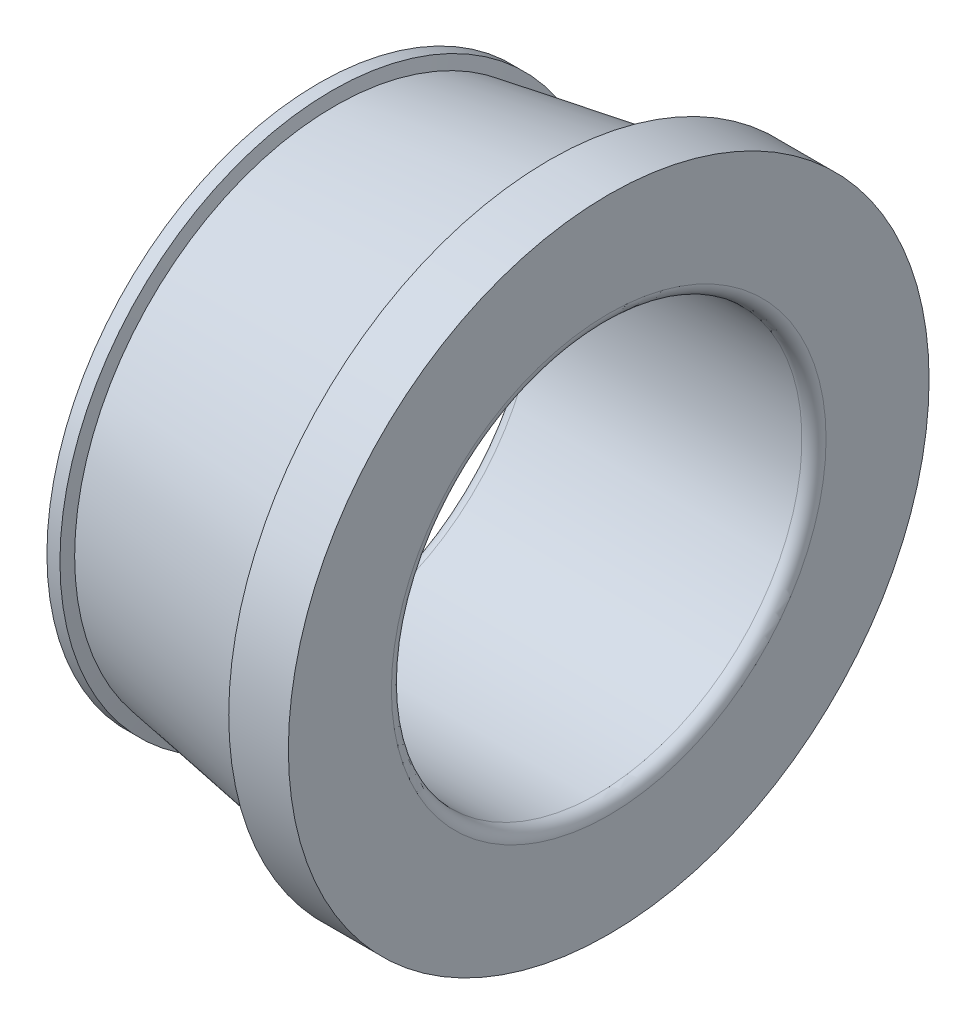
ISO-10303-21;
HEADER;
FILE_DESCRIPTION(('STEP AP214'),'2;1');
FILE_NAME('part.step','',(''),(''),'','','');
FILE_SCHEMA(('AUTOMOTIVE_DESIGN { 1 0 10303 214 1 1 1 1 }'));
ENDSEC;
DATA;
#1=APPLICATION_CONTEXT('core data for automotive mechanical design processes');
#2=APPLICATION_PROTOCOL_DEFINITION('international standard','automotive_design',2000,#1);
#3=PRODUCT_CONTEXT('',#1,'mechanical');
#4=PRODUCT('Part','Part','',(#3));
#5=PRODUCT_RELATED_PRODUCT_CATEGORY('part','',(#4));
#6=PRODUCT_DEFINITION_FORMATION('','',#4);
#7=PRODUCT_DEFINITION_CONTEXT('part definition',#1,'design');
#8=PRODUCT_DEFINITION('design','',#6,#7);
#9=PRODUCT_DEFINITION_SHAPE('','',#8);
#10=(LENGTH_UNIT() NAMED_UNIT(*) SI_UNIT(.MILLI.,.METRE.));
#11=(NAMED_UNIT(*) PLANE_ANGLE_UNIT() SI_UNIT($,.RADIAN.));
#12=(NAMED_UNIT(*) SI_UNIT($,.STERADIAN.) SOLID_ANGLE_UNIT());
#13=UNCERTAINTY_MEASURE_WITH_UNIT(LENGTH_MEASURE(1.E-05),#10,'distance_accuracy_value','');
#14=(GEOMETRIC_REPRESENTATION_CONTEXT(3) GLOBAL_UNCERTAINTY_ASSIGNED_CONTEXT((#13)) GLOBAL_UNIT_ASSIGNED_CONTEXT((#10,
#11,#12)) REPRESENTATION_CONTEXT('',''));
#15=CARTESIAN_POINT('',(0.,0.,0.));
#16=DIRECTION('',(0.,0.,1.));
#17=DIRECTION('',(1.,0.,0.));
#18=AXIS2_PLACEMENT_3D('',#15,#16,#17);
#19=CARTESIAN_POINT('',(1.75,0.,0.));
#20=DIRECTION('',(-1.,0.,0.));
#21=DIRECTION('',(0.,0.,1.));
#22=AXIS2_PLACEMENT_3D('',#19,#20,#21);
#23=TOROIDAL_SURFACE('',#22,9.,0.500000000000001);
#24=CARTESIAN_POINT('',(1.75,0.,0.));
#25=DIRECTION('',(-1.,0.,0.));
#26=DIRECTION('',(0.,0.,1.));
#27=AXIS2_PLACEMENT_3D('',#24,#25,#26);
#28=CIRCLE('',#27,8.5);
#29=CARTESIAN_POINT('',(1.75,0.,8.5));
#30=VERTEX_POINT('',#29);
#31=EDGE_CURVE('E10',#30,#30,#28,.T.);
#32=ORIENTED_EDGE('',*,*,#31,.F.);
#33=EDGE_LOOP('',(#32));
#34=FACE_BOUND('',#33,.T.);
#35=CARTESIAN_POINT('',(1.25,0.,0.));
#36=DIRECTION('',(-1.,0.,0.));
#37=DIRECTION('',(0.,0.,1.));
#38=AXIS2_PLACEMENT_3D('',#35,#36,#37);
#39=CIRCLE('',#38,9.);
#40=CARTESIAN_POINT('',(1.25,0.,9.));
#41=VERTEX_POINT('',#40);
#42=EDGE_CURVE('E66',#41,#41,#39,.T.);
#43=ORIENTED_EDGE('',*,*,#42,.T.);
#44=EDGE_LOOP('',(#43));
#45=FACE_BOUND('',#44,.T.);
#46=ADVANCED_FACE('F32',(#34,#45),#23,.T.);
#47=CARTESIAN_POINT('',(0.,0.,0.));
#48=DIRECTION('',(-1.,0.,0.));
#49=DIRECTION('',(0.,0.,1.));
#50=AXIS2_PLACEMENT_3D('',#47,#48,#49);
#51=CYLINDRICAL_SURFACE('',#50,8.5);
#52=CARTESIAN_POINT('',(12.75,0.,0.));
#53=DIRECTION('',(-1.,0.,0.));
#54=DIRECTION('',(0.,0.,1.));
#55=AXIS2_PLACEMENT_3D('',#52,#53,#54);
#56=CIRCLE('',#55,8.5);
#57=CARTESIAN_POINT('',(12.75,0.,8.5));
#58=VERTEX_POINT('',#57);
#59=EDGE_CURVE('E38',#58,#58,#56,.T.);
#60=ORIENTED_EDGE('',*,*,#59,.F.);
#61=EDGE_LOOP('',(#60));
#62=FACE_BOUND('',#61,.T.);
#63=ORIENTED_EDGE('',*,*,#31,.T.);
#64=EDGE_LOOP('',(#63));
#65=FACE_BOUND('',#64,.T.);
#66=ADVANCED_FACE('F115',(#62,#65),#51,.F.);
#67=CARTESIAN_POINT('',(12.75,0.,0.));
#68=DIRECTION('',(-1.,0.,0.));
#69=DIRECTION('',(0.,0.,1.));
#70=AXIS2_PLACEMENT_3D('',#67,#68,#69);
#71=TOROIDAL_SURFACE('',#70,9.,0.5);
#72=CARTESIAN_POINT('',(13.25,0.,0.));
#73=DIRECTION('',(-1.,0.,0.));
#74=DIRECTION('',(0.,0.,1.));
#75=AXIS2_PLACEMENT_3D('',#72,#73,#74);
#76=CIRCLE('',#75,9.);
#77=CARTESIAN_POINT('',(13.25,0.,9.));
#78=VERTEX_POINT('',#77);
#79=EDGE_CURVE('E42',#78,#78,#76,.T.);
#80=ORIENTED_EDGE('',*,*,#79,.F.);
#81=EDGE_LOOP('',(#80));
#82=FACE_BOUND('',#81,.T.);
#83=ORIENTED_EDGE('',*,*,#59,.T.);
#84=EDGE_LOOP('',(#83));
#85=FACE_BOUND('',#84,.T.);
#86=ADVANCED_FACE('F110',(#82,#85),#71,.T.);
#87=CARTESIAN_POINT('',(13.25,0.,-13.2661097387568));
#88=DIRECTION('',(-1.,0.,0.));
#89=DIRECTION('',(0.,0.,1.));
#90=AXIS2_PLACEMENT_3D('',#87,#88,#89);
#91=PLANE('',#90);
#92=CARTESIAN_POINT('',(13.25,0.,0.));
#93=DIRECTION('',(-1.,0.,0.));
#94=DIRECTION('',(0.,0.,1.));
#95=AXIS2_PLACEMENT_3D('',#92,#93,#94);
#96=CIRCLE('',#95,13.2661097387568);
#97=CARTESIAN_POINT('',(13.25,0.,13.2661097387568));
#98=VERTEX_POINT('',#97);
#99=EDGE_CURVE('E46',#98,#98,#96,.T.);
#100=ORIENTED_EDGE('',*,*,#99,.F.);
#101=EDGE_LOOP('',(#100));
#102=FACE_BOUND('',#101,.T.);
#103=ORIENTED_EDGE('',*,*,#79,.T.);
#104=EDGE_LOOP('',(#103));
#105=FACE_BOUND('',#104,.T.);
#106=ADVANCED_FACE('F104',(#102,#105),#91,.F.);
#107=CARTESIAN_POINT('',(0.,0.,0.));
#108=DIRECTION('',(-1.,0.,0.));
#109=DIRECTION('',(0.,0.,1.));
#110=AXIS2_PLACEMENT_3D('',#107,#108,#109);
#111=CYLINDRICAL_SURFACE('',#110,13.2661097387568);
#112=CARTESIAN_POINT('',(10.780701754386,0.,0.));
#113=DIRECTION('',(-1.,0.,0.));
#114=DIRECTION('',(0.,0.,1.));
#115=AXIS2_PLACEMENT_3D('',#112,#113,#114);
#116=CIRCLE('',#115,13.2661097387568);
#117=CARTESIAN_POINT('',(10.780701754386,0.,13.2661097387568));
#118=VERTEX_POINT('',#117);
#119=EDGE_CURVE('E51',#118,#118,#116,.T.);
#120=ORIENTED_EDGE('',*,*,#119,.F.);
#121=EDGE_LOOP('',(#120));
#122=FACE_BOUND('',#121,.T.);
#123=ORIENTED_EDGE('',*,*,#99,.T.);
#124=EDGE_LOOP('',(#123));
#125=FACE_BOUND('',#124,.T.);
#126=ADVANCED_FACE('F98',(#122,#125),#111,.T.);
#127=CARTESIAN_POINT('',(10.780701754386,0.,0.));
#128=DIRECTION('',(-1.,0.,0.));
#129=DIRECTION('',(0.,0.,1.));
#130=AXIS2_PLACEMENT_3D('',#127,#128,#129);
#131=CONICAL_SURFACE('',#130,13.2661097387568,1.35491547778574);
#132=CARTESIAN_POINT('',(11.,0.,0.));
#133=DIRECTION('',(-1.,0.,0.));
#134=DIRECTION('',(0.,0.,1.));
#135=AXIS2_PLACEMENT_3D('',#132,#133,#134);
#136=CIRCLE('',#135,12.2661097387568);
#137=CARTESIAN_POINT('',(11.,0.,12.2661097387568));
#138=VERTEX_POINT('',#137);
#139=EDGE_CURVE('E54',#138,#138,#136,.T.);
#140=ORIENTED_EDGE('',*,*,#139,.F.);
#141=EDGE_LOOP('',(#140));
#142=FACE_BOUND('',#141,.T.);
#143=ORIENTED_EDGE('',*,*,#119,.T.);
#144=EDGE_LOOP('',(#143));
#145=FACE_BOUND('',#144,.T.);
#146=ADVANCED_FACE('F92',(#142,#145),#131,.F.);
#147=CARTESIAN_POINT('',(11.,0.,0.));
#148=DIRECTION('',(1.,0.,0.));
#149=DIRECTION('',(0.,0.,-1.));
#150=AXIS2_PLACEMENT_3D('',#147,#148,#149);
#151=CONICAL_SURFACE('',#150,12.2661097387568,0.163520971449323);
#152=CARTESIAN_POINT('',(1.89844280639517,0.,0.));
#153=DIRECTION('',(-1.,0.,0.));
#154=DIRECTION('',(0.,0.,1.));
#155=AXIS2_PLACEMENT_3D('',#152,#153,#154);
#156=CIRCLE('',#155,10.7644056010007);
#157=CARTESIAN_POINT('',(1.89844280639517,0.,10.7644056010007));
#158=VERTEX_POINT('',#157);
#159=EDGE_CURVE('E57',#158,#158,#156,.T.);
#160=ORIENTED_EDGE('',*,*,#159,.F.);
#161=EDGE_LOOP('',(#160));
#162=FACE_BOUND('',#161,.T.);
#163=ORIENTED_EDGE('',*,*,#139,.T.);
#164=EDGE_LOOP('',(#163));
#165=FACE_BOUND('',#164,.T.);
#166=ADVANCED_FACE('F86',(#162,#165),#151,.T.);
#167=CARTESIAN_POINT('',(1.89844280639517,0.,0.));
#168=DIRECTION('',(-1.,0.,0.));
#169=DIRECTION('',(0.,0.,1.));
#170=AXIS2_PLACEMENT_3D('',#167,#168,#169);
#171=CONICAL_SURFACE('',#170,10.7644056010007,1.35491547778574);
#172=CARTESIAN_POINT('',(1.78879368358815,0.,0.));
#173=DIRECTION('',(-1.,0.,0.));
#174=DIRECTION('',(0.,0.,1.));
#175=AXIS2_PLACEMENT_3D('',#172,#173,#174);
#176=CIRCLE('',#175,11.2644056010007);
#177=CARTESIAN_POINT('',(1.78879368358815,0.,11.2644056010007));
#178=VERTEX_POINT('',#177);
#179=EDGE_CURVE('E60',#178,#178,#176,.T.);
#180=ORIENTED_EDGE('',*,*,#179,.F.);
#181=EDGE_LOOP('',(#180));
#182=FACE_BOUND('',#181,.T.);
#183=ORIENTED_EDGE('',*,*,#159,.T.);
#184=EDGE_LOOP('',(#183));
#185=FACE_BOUND('',#184,.T.);
#186=ADVANCED_FACE('F80',(#182,#185),#171,.T.);
#187=CARTESIAN_POINT('',(0.,0.,0.));
#188=DIRECTION('',(-1.,0.,0.));
#189=DIRECTION('',(0.,0.,1.));
#190=AXIS2_PLACEMENT_3D('',#187,#188,#189);
#191=CYLINDRICAL_SURFACE('',#190,11.2644056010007);
#192=CARTESIAN_POINT('',(1.25,0.,0.));
#193=DIRECTION('',(-1.,0.,0.));
#194=DIRECTION('',(0.,0.,1.));
#195=AXIS2_PLACEMENT_3D('',#192,#193,#194);
#196=CIRCLE('',#195,11.2644056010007);
#197=CARTESIAN_POINT('',(1.25,0.,11.2644056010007));
#198=VERTEX_POINT('',#197);
#199=EDGE_CURVE('E63',#198,#198,#196,.T.);
#200=ORIENTED_EDGE('',*,*,#199,.F.);
#201=EDGE_LOOP('',(#200));
#202=FACE_BOUND('',#201,.T.);
#203=ORIENTED_EDGE('',*,*,#179,.T.);
#204=EDGE_LOOP('',(#203));
#205=FACE_BOUND('',#204,.T.);
#206=ADVANCED_FACE('F74',(#202,#205),#191,.T.);
#207=CARTESIAN_POINT('',(1.25,0.,-9.));
#208=DIRECTION('',(1.,0.,0.));
#209=DIRECTION('',(0.,0.,-1.));
#210=AXIS2_PLACEMENT_3D('',#207,#208,#209);
#211=PLANE('',#210);
#212=ORIENTED_EDGE('',*,*,#42,.F.);
#213=EDGE_LOOP('',(#212));
#214=FACE_BOUND('',#213,.T.);
#215=ORIENTED_EDGE('',*,*,#199,.T.);
#216=EDGE_LOOP('',(#215));
#217=FACE_BOUND('',#216,.T.);
#218=ADVANCED_FACE('F71',(#214,#217),#211,.F.);
#219=CLOSED_SHELL('',(#46,#66,#86,#106,#126,#146,#166,#186,#206,#218));
#220=MANIFOLD_SOLID_BREP('B2',#219);
#221=ADVANCED_BREP_SHAPE_REPRESENTATION('',(#18,#220),#14);
#222=SHAPE_DEFINITION_REPRESENTATION(#9,#221);
ENDSEC;
END-ISO-10303-21;
